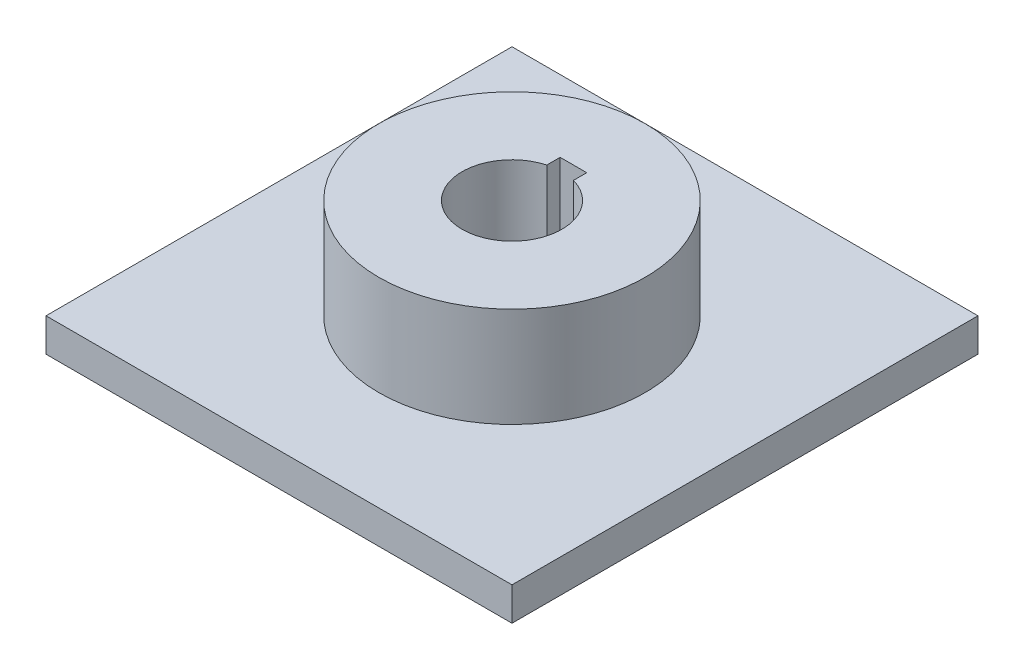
ISO-10303-21;
HEADER;
FILE_DESCRIPTION(('STEP AP214'),'2;1');
FILE_NAME('part.step','',(''),(''),'','','');
FILE_SCHEMA(('AUTOMOTIVE_DESIGN { 1 0 10303 214 1 1 1 1 }'));
ENDSEC;
DATA;
#1=APPLICATION_CONTEXT('core data for automotive mechanical design processes');
#2=APPLICATION_PROTOCOL_DEFINITION('international standard','automotive_design',2000,#1);
#3=PRODUCT_CONTEXT('',#1,'mechanical');
#4=PRODUCT('Part','Part','',(#3));
#5=PRODUCT_RELATED_PRODUCT_CATEGORY('part','',(#4));
#6=PRODUCT_DEFINITION_FORMATION('','',#4);
#7=PRODUCT_DEFINITION_CONTEXT('part definition',#1,'design');
#8=PRODUCT_DEFINITION('design','',#6,#7);
#9=PRODUCT_DEFINITION_SHAPE('','',#8);
#10=(LENGTH_UNIT() NAMED_UNIT(*) SI_UNIT(.MILLI.,.METRE.));
#11=(NAMED_UNIT(*) PLANE_ANGLE_UNIT() SI_UNIT($,.RADIAN.));
#12=(NAMED_UNIT(*) SI_UNIT($,.STERADIAN.) SOLID_ANGLE_UNIT());
#13=UNCERTAINTY_MEASURE_WITH_UNIT(LENGTH_MEASURE(1.E-05),#10,'distance_accuracy_value','');
#14=(GEOMETRIC_REPRESENTATION_CONTEXT(3) GLOBAL_UNCERTAINTY_ASSIGNED_CONTEXT((#13)) GLOBAL_UNIT_ASSIGNED_CONTEXT((#10,
#11,#12)) REPRESENTATION_CONTEXT('',''));
#15=CARTESIAN_POINT('',(0.,0.,0.));
#16=DIRECTION('',(0.,0.,1.));
#17=DIRECTION('',(1.,0.,0.));
#18=AXIS2_PLACEMENT_3D('',#15,#16,#17);
#19=CARTESIAN_POINT('',(0.,5.,0.));
#20=DIRECTION('',(0.,1.,0.));
#21=DIRECTION('',(0.,0.,1.));
#22=AXIS2_PLACEMENT_3D('',#19,#20,#21);
#23=PLANE('',#22);
#24=DIRECTION('',(0.,0.,-1.));
#25=VECTOR('',#24,1.);
#26=CARTESIAN_POINT('',(35.,5.,-35.));
#27=LINE('',#26,#25);
#28=CARTESIAN_POINT('',(35.,5.,35.));
#29=VERTEX_POINT('',#28);
#30=CARTESIAN_POINT('',(35.,5.,-35.));
#31=VERTEX_POINT('',#30);
#32=EDGE_CURVE('E139',#29,#31,#27,.T.);
#33=ORIENTED_EDGE('',*,*,#32,.T.);
#34=DIRECTION('',(-1.,0.,0.));
#35=VECTOR('',#34,1.);
#36=CARTESIAN_POINT('',(-35.,5.,-35.));
#37=LINE('',#36,#35);
#38=CARTESIAN_POINT('',(-35.,5.,-35.));
#39=VERTEX_POINT('',#38);
#40=EDGE_CURVE('E142',#31,#39,#37,.T.);
#41=ORIENTED_EDGE('',*,*,#40,.T.);
#42=DIRECTION('',(0.,0.,1.));
#43=VECTOR('',#42,1.);
#44=CARTESIAN_POINT('',(-35.,5.,-35.));
#45=LINE('',#44,#43);
#46=CARTESIAN_POINT('',(-35.,5.,35.));
#47=VERTEX_POINT('',#46);
#48=EDGE_CURVE('E145',#39,#47,#45,.T.);
#49=ORIENTED_EDGE('',*,*,#48,.T.);
#50=DIRECTION('',(1.,0.,0.));
#51=VECTOR('',#50,1.);
#52=CARTESIAN_POINT('',(-35.,5.,35.));
#53=LINE('',#52,#51);
#54=EDGE_CURVE('E147',#47,#29,#53,.T.);
#55=ORIENTED_EDGE('',*,*,#54,.T.);
#56=EDGE_LOOP('',(#33,#41,#49,#55));
#57=FACE_BOUND('',#56,.T.);
#58=CARTESIAN_POINT('',(0.,5.,0.));
#59=DIRECTION('',(0.,1.,0.));
#60=DIRECTION('',(0.,0.,1.));
#61=AXIS2_PLACEMENT_3D('',#58,#59,#60);
#62=CIRCLE('',#61,20.);
#63=CARTESIAN_POINT('',(0.,5.,20.));
#64=VERTEX_POINT('',#63);
#65=EDGE_CURVE('E111',#64,#64,#62,.T.);
#66=ORIENTED_EDGE('',*,*,#65,.F.);
#67=EDGE_LOOP('',(#66));
#68=FACE_BOUND('',#67,.T.);
#69=ADVANCED_FACE('F32',(#57,#68),#23,.T.);
#70=CARTESIAN_POINT('',(35.,5.,-35.));
#71=DIRECTION('',(-1.,0.,0.));
#72=DIRECTION('',(0.,0.,1.));
#73=AXIS2_PLACEMENT_3D('',#70,#71,#72);
#74=PLANE('',#73);
#75=DIRECTION('',(0.,0.,-1.));
#76=VECTOR('',#75,1.);
#77=CARTESIAN_POINT('',(35.,0.,-35.));
#78=LINE('',#77,#76);
#79=CARTESIAN_POINT('',(35.,0.,35.));
#80=VERTEX_POINT('',#79);
#81=CARTESIAN_POINT('',(35.,0.,-35.));
#82=VERTEX_POINT('',#81);
#83=EDGE_CURVE('E136',#80,#82,#78,.T.);
#84=ORIENTED_EDGE('',*,*,#83,.T.);
#85=DIRECTION('',(0.,-1.,0.));
#86=VECTOR('',#85,1.);
#87=CARTESIAN_POINT('',(35.,5.,-35.));
#88=LINE('',#87,#86);
#89=EDGE_CURVE('E11',#31,#82,#88,.T.);
#90=ORIENTED_EDGE('',*,*,#89,.F.);
#91=ORIENTED_EDGE('',*,*,#32,.F.);
#92=DIRECTION('',(0.,-1.,0.));
#93=VECTOR('',#92,1.);
#94=CARTESIAN_POINT('',(35.,5.,35.));
#95=LINE('',#94,#93);
#96=EDGE_CURVE('E149',#29,#80,#95,.T.);
#97=ORIENTED_EDGE('',*,*,#96,.T.);
#98=EDGE_LOOP('',(#84,#90,#91,#97));
#99=FACE_BOUND('',#98,.T.);
#100=ADVANCED_FACE('F34',(#99),#74,.F.);
#101=CARTESIAN_POINT('',(-35.,5.,-35.));
#102=DIRECTION('',(0.,0.,1.));
#103=DIRECTION('',(1.,0.,0.));
#104=AXIS2_PLACEMENT_3D('',#101,#102,#103);
#105=PLANE('',#104);
#106=DIRECTION('',(-1.,0.,0.));
#107=VECTOR('',#106,1.);
#108=CARTESIAN_POINT('',(-35.,0.,-35.));
#109=LINE('',#108,#107);
#110=CARTESIAN_POINT('',(-35.,0.,-35.));
#111=VERTEX_POINT('',#110);
#112=EDGE_CURVE('E152',#82,#111,#109,.T.);
#113=ORIENTED_EDGE('',*,*,#112,.T.);
#114=DIRECTION('',(0.,-1.,0.));
#115=VECTOR('',#114,1.);
#116=CARTESIAN_POINT('',(-35.,5.,-35.));
#117=LINE('',#116,#115);
#118=EDGE_CURVE('E40',#39,#111,#117,.T.);
#119=ORIENTED_EDGE('',*,*,#118,.F.);
#120=ORIENTED_EDGE('',*,*,#40,.F.);
#121=ORIENTED_EDGE('',*,*,#89,.T.);
#122=EDGE_LOOP('',(#113,#119,#120,#121));
#123=FACE_BOUND('',#122,.T.);
#124=ADVANCED_FACE('F182',(#123),#105,.F.);
#125=CARTESIAN_POINT('',(-35.,5.,-35.));
#126=DIRECTION('',(1.,0.,0.));
#127=DIRECTION('',(0.,0.,-1.));
#128=AXIS2_PLACEMENT_3D('',#125,#126,#127);
#129=PLANE('',#128);
#130=DIRECTION('',(0.,0.,1.));
#131=VECTOR('',#130,1.);
#132=CARTESIAN_POINT('',(-35.,0.,-35.));
#133=LINE('',#132,#131);
#134=CARTESIAN_POINT('',(-35.,0.,35.));
#135=VERTEX_POINT('',#134);
#136=EDGE_CURVE('E154',#111,#135,#133,.T.);
#137=ORIENTED_EDGE('',*,*,#136,.T.);
#138=DIRECTION('',(0.,-1.,0.));
#139=VECTOR('',#138,1.);
#140=CARTESIAN_POINT('',(-35.,5.,35.));
#141=LINE('',#140,#139);
#142=EDGE_CURVE('E159',#47,#135,#141,.T.);
#143=ORIENTED_EDGE('',*,*,#142,.F.);
#144=ORIENTED_EDGE('',*,*,#48,.F.);
#145=ORIENTED_EDGE('',*,*,#118,.T.);
#146=EDGE_LOOP('',(#137,#143,#144,#145));
#147=FACE_BOUND('',#146,.T.);
#148=ADVANCED_FACE('F166',(#147),#129,.F.);
#149=CARTESIAN_POINT('',(-35.,5.,35.));
#150=DIRECTION('',(0.,0.,-1.));
#151=DIRECTION('',(-1.,0.,0.));
#152=AXIS2_PLACEMENT_3D('',#149,#150,#151);
#153=PLANE('',#152);
#154=DIRECTION('',(1.,0.,0.));
#155=VECTOR('',#154,1.);
#156=CARTESIAN_POINT('',(-35.,0.,35.));
#157=LINE('',#156,#155);
#158=EDGE_CURVE('E143',#135,#80,#157,.T.);
#159=ORIENTED_EDGE('',*,*,#158,.T.);
#160=ORIENTED_EDGE('',*,*,#96,.F.);
#161=ORIENTED_EDGE('',*,*,#54,.F.);
#162=ORIENTED_EDGE('',*,*,#142,.T.);
#163=EDGE_LOOP('',(#159,#160,#161,#162));
#164=FACE_BOUND('',#163,.T.);
#165=ADVANCED_FACE('F175',(#164),#153,.F.);
#166=CARTESIAN_POINT('',(0.,0.,0.));
#167=DIRECTION('',(0.,1.,0.));
#168=DIRECTION('',(0.,0.,1.));
#169=AXIS2_PLACEMENT_3D('',#166,#167,#168);
#170=PLANE('',#169);
#171=ORIENTED_EDGE('',*,*,#83,.F.);
#172=ORIENTED_EDGE('',*,*,#158,.F.);
#173=ORIENTED_EDGE('',*,*,#136,.F.);
#174=ORIENTED_EDGE('',*,*,#112,.F.);
#175=EDGE_LOOP('',(#171,#172,#173,#174));
#176=FACE_BOUND('',#175,.T.);
#177=ADVANCED_FACE('F172',(#176),#170,.F.);
#178=CARTESIAN_POINT('',(0.,20.,0.));
#179=DIRECTION('',(0.,1.,0.));
#180=DIRECTION('',(0.,0.,1.));
#181=AXIS2_PLACEMENT_3D('',#178,#179,#180);
#182=PLANE('',#181);
#183=CARTESIAN_POINT('',(0.,20.,0.));
#184=DIRECTION('',(0.,1.,0.));
#185=DIRECTION('',(0.,0.,1.));
#186=AXIS2_PLACEMENT_3D('',#183,#184,#185);
#187=CIRCLE('',#186,20.);
#188=CARTESIAN_POINT('',(0.,20.,20.));
#189=VERTEX_POINT('',#188);
#190=EDGE_CURVE('E133',#189,#189,#187,.T.);
#191=ORIENTED_EDGE('',*,*,#190,.T.);
#192=EDGE_LOOP('',(#191));
#193=FACE_BOUND('',#192,.T.);
#194=DIRECTION('',(0.,0.,-1.));
#195=VECTOR('',#194,1.);
#196=CARTESIAN_POINT('',(2.,20.,-9.22841614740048));
#197=LINE('',#196,#195);
#198=CARTESIAN_POINT('',(2.,20.,-7.22841614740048));
#199=VERTEX_POINT('',#198);
#200=CARTESIAN_POINT('',(2.,20.,-9.22841614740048));
#201=VERTEX_POINT('',#200);
#202=EDGE_CURVE('E105',#199,#201,#197,.T.);
#203=ORIENTED_EDGE('',*,*,#202,.F.);
#204=CARTESIAN_POINT('',(0.,20.,0.));
#205=DIRECTION('',(0.,1.,0.));
#206=DIRECTION('',(0.,0.,1.));
#207=AXIS2_PLACEMENT_3D('',#204,#205,#206);
#208=CIRCLE('',#207,7.5);
#209=CARTESIAN_POINT('',(-2.,20.,-7.22841614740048));
#210=VERTEX_POINT('',#209);
#211=EDGE_CURVE('E96',#210,#199,#208,.T.);
#212=ORIENTED_EDGE('',*,*,#211,.F.);
#213=DIRECTION('',(0.,0.,1.));
#214=VECTOR('',#213,1.);
#215=CARTESIAN_POINT('',(-2.,20.,-7.22841614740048));
#216=LINE('',#215,#214);
#217=CARTESIAN_POINT('',(-2.,20.,-9.22841614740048));
#218=VERTEX_POINT('',#217);
#219=EDGE_CURVE('E119',#218,#210,#216,.T.);
#220=ORIENTED_EDGE('',*,*,#219,.F.);
#221=DIRECTION('',(-1.,0.,0.));
#222=VECTOR('',#221,1.);
#223=CARTESIAN_POINT('',(-2.,20.,-9.22841614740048));
#224=LINE('',#223,#222);
#225=EDGE_CURVE('E117',#201,#218,#224,.T.);
#226=ORIENTED_EDGE('',*,*,#225,.F.);
#227=EDGE_LOOP('',(#203,#212,#220,#226));
#228=FACE_BOUND('',#227,.T.);
#229=ADVANCED_FACE('F115',(#193,#228),#182,.T.);
#230=CARTESIAN_POINT('',(0.,20.,0.));
#231=DIRECTION('',(0.,-1.,0.));
#232=DIRECTION('',(0.,0.,-1.));
#233=AXIS2_PLACEMENT_3D('',#230,#231,#232);
#234=CYLINDRICAL_SURFACE('',#233,20.);
#235=ORIENTED_EDGE('',*,*,#190,.F.);
#236=EDGE_LOOP('',(#235));
#237=FACE_BOUND('',#236,.T.);
#238=ORIENTED_EDGE('',*,*,#65,.T.);
#239=EDGE_LOOP('',(#238));
#240=FACE_BOUND('',#239,.T.);
#241=ADVANCED_FACE('F215',(#237,#240),#234,.T.);
#242=CARTESIAN_POINT('',(0.,20.,0.));
#243=DIRECTION('',(0.,-1.,0.));
#244=DIRECTION('',(0.,0.,-1.));
#245=AXIS2_PLACEMENT_3D('',#242,#243,#244);
#246=CYLINDRICAL_SURFACE('',#245,7.5);
#247=CARTESIAN_POINT('',(0.,5.,0.));
#248=DIRECTION('',(0.,1.,0.));
#249=DIRECTION('',(0.,0.,1.));
#250=AXIS2_PLACEMENT_3D('',#247,#248,#249);
#251=CIRCLE('',#250,7.5);
#252=CARTESIAN_POINT('',(-2.,5.,-7.22841614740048));
#253=VERTEX_POINT('',#252);
#254=CARTESIAN_POINT('',(2.,5.,-7.22841614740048));
#255=VERTEX_POINT('',#254);
#256=EDGE_CURVE('E47',#253,#255,#251,.T.);
#257=ORIENTED_EDGE('',*,*,#256,.F.);
#258=DIRECTION('',(0.,-1.,0.));
#259=VECTOR('',#258,1.);
#260=CARTESIAN_POINT('',(-2.,20.,-7.22841614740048));
#261=LINE('',#260,#259);
#262=EDGE_CURVE('E101',#210,#253,#261,.T.);
#263=ORIENTED_EDGE('',*,*,#262,.F.);
#264=ORIENTED_EDGE('',*,*,#211,.T.);
#265=DIRECTION('',(0.,-1.,0.));
#266=VECTOR('',#265,1.);
#267=CARTESIAN_POINT('',(2.,20.,-7.22841614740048));
#268=LINE('',#267,#266);
#269=EDGE_CURVE('E99',#199,#255,#268,.T.);
#270=ORIENTED_EDGE('',*,*,#269,.T.);
#271=EDGE_LOOP('',(#257,#263,#264,#270));
#272=FACE_BOUND('',#271,.T.);
#273=ADVANCED_FACE('F98',(#272),#246,.F.);
#274=CARTESIAN_POINT('',(2.,20.,-9.22841614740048));
#275=DIRECTION('',(-1.,0.,0.));
#276=DIRECTION('',(0.,0.,1.));
#277=AXIS2_PLACEMENT_3D('',#274,#275,#276);
#278=PLANE('',#277);
#279=DIRECTION('',(0.,0.,-1.));
#280=VECTOR('',#279,1.);
#281=CARTESIAN_POINT('',(2.,5.,-9.22841614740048));
#282=LINE('',#281,#280);
#283=CARTESIAN_POINT('',(2.,5.,-9.22841614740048));
#284=VERTEX_POINT('',#283);
#285=EDGE_CURVE('E51',#255,#284,#282,.T.);
#286=ORIENTED_EDGE('',*,*,#285,.F.);
#287=ORIENTED_EDGE('',*,*,#269,.F.);
#288=ORIENTED_EDGE('',*,*,#202,.T.);
#289=DIRECTION('',(0.,-1.,0.));
#290=VECTOR('',#289,1.);
#291=CARTESIAN_POINT('',(2.,20.,-9.22841614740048));
#292=LINE('',#291,#290);
#293=EDGE_CURVE('E112',#201,#284,#292,.T.);
#294=ORIENTED_EDGE('',*,*,#293,.T.);
#295=EDGE_LOOP('',(#286,#287,#288,#294));
#296=FACE_BOUND('',#295,.T.);
#297=ADVANCED_FACE('F109',(#296),#278,.T.);
#298=CARTESIAN_POINT('',(-2.,20.,-9.22841614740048));
#299=DIRECTION('',(0.,0.,1.));
#300=DIRECTION('',(1.,0.,0.));
#301=AXIS2_PLACEMENT_3D('',#298,#299,#300);
#302=PLANE('',#301);
#303=DIRECTION('',(-1.,0.,0.));
#304=VECTOR('',#303,1.);
#305=CARTESIAN_POINT('',(-2.,5.,-9.22841614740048));
#306=LINE('',#305,#304);
#307=CARTESIAN_POINT('',(-2.,5.,-9.22841614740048));
#308=VERTEX_POINT('',#307);
#309=EDGE_CURVE('E125',#284,#308,#306,.T.);
#310=ORIENTED_EDGE('',*,*,#309,.F.);
#311=ORIENTED_EDGE('',*,*,#293,.F.);
#312=ORIENTED_EDGE('',*,*,#225,.T.);
#313=DIRECTION('',(0.,-1.,0.));
#314=VECTOR('',#313,1.);
#315=CARTESIAN_POINT('',(-2.,20.,-9.22841614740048));
#316=LINE('',#315,#314);
#317=EDGE_CURVE('E129',#218,#308,#316,.T.);
#318=ORIENTED_EDGE('',*,*,#317,.T.);
#319=EDGE_LOOP('',(#310,#311,#312,#318));
#320=FACE_BOUND('',#319,.T.);
#321=ADVANCED_FACE('F201',(#320),#302,.T.);
#322=CARTESIAN_POINT('',(-2.,20.,-7.22841614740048));
#323=DIRECTION('',(1.,0.,0.));
#324=DIRECTION('',(0.,0.,-1.));
#325=AXIS2_PLACEMENT_3D('',#322,#323,#324);
#326=PLANE('',#325);
#327=DIRECTION('',(0.,0.,1.));
#328=VECTOR('',#327,1.);
#329=CARTESIAN_POINT('',(-2.,5.,-7.22841614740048));
#330=LINE('',#329,#328);
#331=EDGE_CURVE('E106',#308,#253,#330,.T.);
#332=ORIENTED_EDGE('',*,*,#331,.F.);
#333=ORIENTED_EDGE('',*,*,#317,.F.);
#334=ORIENTED_EDGE('',*,*,#219,.T.);
#335=ORIENTED_EDGE('',*,*,#262,.T.);
#336=EDGE_LOOP('',(#332,#333,#334,#335));
#337=FACE_BOUND('',#336,.T.);
#338=ADVANCED_FACE('F197',(#337),#326,.T.);
#339=ORIENTED_EDGE('',*,*,#256,.T.);
#340=ORIENTED_EDGE('',*,*,#285,.T.);
#341=ORIENTED_EDGE('',*,*,#309,.T.);
#342=ORIENTED_EDGE('',*,*,#331,.T.);
#343=EDGE_LOOP('',(#339,#340,#341,#342));
#344=FACE_BOUND('',#343,.T.);
#345=ADVANCED_FACE('F191',(#344),#23,.T.);
#346=CLOSED_SHELL('',(#69,#100,#124,#148,#165,#177,#229,#241,#273,#297,#321,#338,#345));
#347=MANIFOLD_SOLID_BREP('B2',#346);
#348=ADVANCED_BREP_SHAPE_REPRESENTATION('',(#18,#347),#14);
#349=SHAPE_DEFINITION_REPRESENTATION(#9,#348);
ENDSEC;
END-ISO-10303-21;
